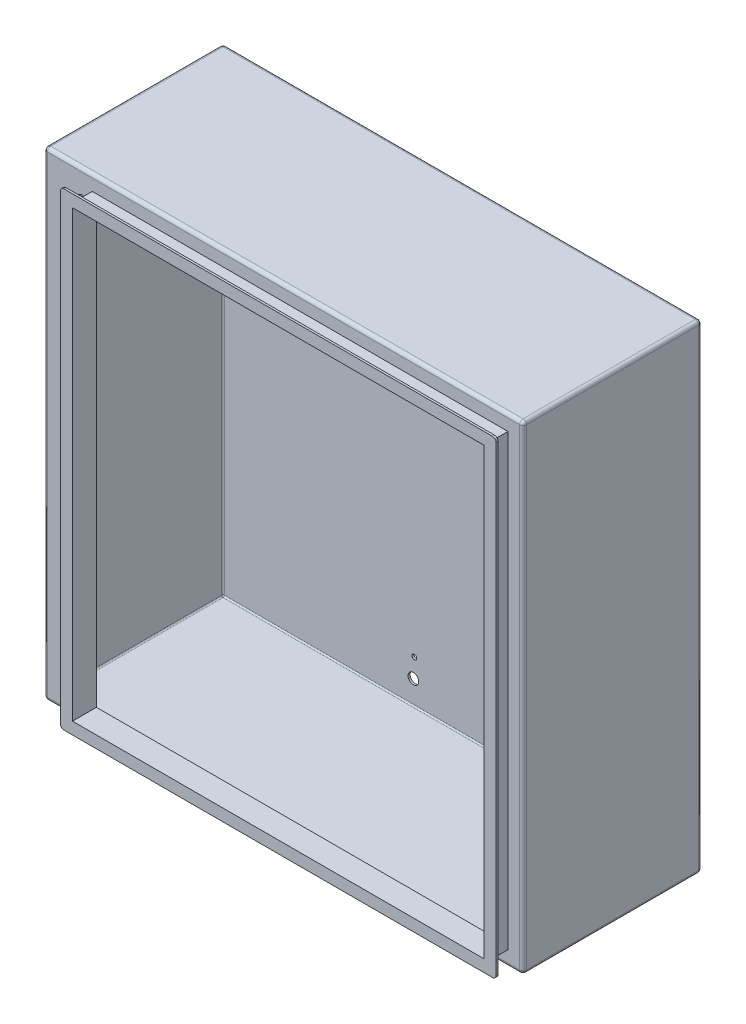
from build123d import *

# Parameters (mm, degrees)
SKETCH63_W                           = 355.6
SKETCH63_H                           = 355.6
BOSS_EXTRUDE1_DEPTH                  = 132.842
SKETCH64_W                           = 308.61
SKETCH64_H                           = 333.248
BOSS_EXTRUDE2_DEPTH                  = 14.732
FILLET1_R                            = 2.54
SHELL1_T                             = -1.524
SKETCH65_W                           = 323.342
SKETCH65_H                           = 347.98
SKETCH65_W_2                         = 305.562
SKETCH65_H_2                         = 330.2
BOSS_EXTRUDE3_DEPTH                  = 1.524
FILLET2_R                            = 2.54
CUT_EXTRUDE1_REACH                   = 294.328
SKETCH66_R                           = 1.7526
SKETCH66_R_2                         = 3.9624
F_17_64_0_26563_DIAMETER_HOLE1_D     = 6.747002
F_17_64_0_26563_DIAMETER_HOLE1_DEPTH = 1.524


with BuildPart() as part:
    # Sketch63 → Boss-Extrude1 (new body)
    with BuildSketch(Plane.XY):
        Rectangle(SKETCH63_W, SKETCH63_H)
    extrude(amount=BOSS_EXTRUDE1_DEPTH)

    # Sketch64 → Boss-Extrude2 (add)
    with BuildSketch(Plane.XY.offset(132.842)):
        with Locations((12.319, 0)):
            Rectangle(SKETCH64_W, SKETCH64_H)
    extrude(amount=BOSS_EXTRUDE2_DEPTH)

    # Fillet1
    fillet1_edges = [part.edges().sort_by_distance(p)[0] for p in [
        (177.8, 0, 132.842),
        (0, 177.8, 132.842),
        (-177.8, 0, 132.842),
        (0, 177.8, 0),
        (177.8, 0, 0),
        (0, -177.8, 0),
        (-177.8, 0, 0),
        (0, -177.8, 132.842),
        (-177.8, 177.8, 66.421),
        (177.8, 177.8, 66.421),
        (177.8, -177.8, 66.421),
        (-177.8, -177.8, 66.421),
    ]]
    fillet(fillet1_edges, radius=FILLET1_R)

    # Shell1
    shell1_openings = [part.faces().sort_by_distance(p)[0] for p in [
        (12.319, 0, 147.574),
    ]]
    offset(amount=SHELL1_T, openings=shell1_openings, kind=Kind.INTERSECTION)

    # Sketch65 → Boss-Extrude3 (add)
    with BuildSketch(Plane.XY.offset(147.574)):
        with Locations((12.319, 0)):
            Rectangle(SKETCH65_W, SKETCH65_H)
        with Locations((12.319, 0)):
            Rectangle(SKETCH65_W_2, SKETCH65_H_2, mode=Mode.SUBTRACT)
    extrude(amount=BOSS_EXTRUDE3_DEPTH)

    # Fillet2
    fillet2_edges = [part.edges().sort_by_distance(p)[0] for p in [
        (173.99, 173.99, 148.336),
        (-149.352, 173.99, 148.336),
        (-149.352, -173.99, 148.336),
        (173.99, -173.99, 148.336),
    ]]
    fillet(fillet2_edges, radius=FILLET2_R)

    # Sketch66 → Cut-Extrude1 (cut, up to next)
    with BuildSketch(Plane(origin=(0, 0, 0), x_dir=(-1, 0, 0), z_dir=(0, 0, -1)), mode=Mode.PRIVATE) as cut_extrude1_sk1:
        with Locations((34.16896135, -144.514863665)):
            Circle(SKETCH66_R)
    cut_extrude1_tool1 = extrude(cut_extrude1_sk1.sketch, amount=-CUT_EXTRUDE1_REACH, mode=Mode.PRIVATE) & part.part
    # Sketch66 → Cut-Extrude1 (cut, up to next)
    with BuildSketch(Plane(origin=(0, 0, 0), x_dir=(-1, 0, 0), z_dir=(0, 0, -1)), mode=Mode.PRIVATE) as cut_extrude1_sk2:
        with Locations((34.93096135, -158.758173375)):
            Circle(SKETCH66_R_2)
    cut_extrude1_tool2 = extrude(cut_extrude1_sk2.sketch, amount=-CUT_EXTRUDE1_REACH, mode=Mode.PRIVATE) & part.part
    # Sketch66 → Cut-Extrude1 (cut, up to next)
    with BuildSketch(Plane(origin=(0, 0, 0), x_dir=(-1, 0, 0), z_dir=(0, 0, -1)), mode=Mode.PRIVATE) as cut_extrude1_sk3:
        with Locations((-34.91903865, -158.758173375)):
            Circle(SKETCH66_R_2)
    cut_extrude1_tool3 = extrude(cut_extrude1_sk3.sketch, amount=-CUT_EXTRUDE1_REACH, mode=Mode.PRIVATE) & part.part
    # Sketch66 → Cut-Extrude1 (cut, up to next)
    with BuildSketch(Plane(origin=(0, 0, 0), x_dir=(-1, 0, 0), z_dir=(0, 0, -1)), mode=Mode.PRIVATE) as cut_extrude1_sk4:
        with Locations((-34.15703865, -144.514863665)):
            Circle(SKETCH66_R)
    cut_extrude1_tool4 = extrude(cut_extrude1_sk4.sketch, amount=-CUT_EXTRUDE1_REACH, mode=Mode.PRIVATE) & part.part
    # Sketch66 → Cut-Extrude1 (cut, up to next)
    with BuildSketch(Plane(origin=(0, 0, 0), x_dir=(-1, 0, 0), z_dir=(0, 0, -1)), mode=Mode.PRIVATE) as cut_extrude1_sk5:
        with Locations((34.16896135, 93.229585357)):
            Circle(SKETCH66_R)
    cut_extrude1_tool5 = extrude(cut_extrude1_sk5.sketch, amount=-CUT_EXTRUDE1_REACH, mode=Mode.PRIVATE) & part.part
    # Sketch66 → Cut-Extrude1 (cut, up to next)
    with BuildSketch(Plane(origin=(0, 0, 0), x_dir=(-1, 0, 0), z_dir=(0, 0, -1)), mode=Mode.PRIVATE) as cut_extrude1_sk6:
        with Locations((-34.15703865, 93.229585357)):
            Circle(SKETCH66_R)
    cut_extrude1_tool6 = extrude(cut_extrude1_sk6.sketch, amount=-CUT_EXTRUDE1_REACH, mode=Mode.PRIVATE) & part.part
    # Sketch66 → Cut-Extrude1 (cut, up to next)
    with BuildSketch(Plane(origin=(0, 0, 0), x_dir=(-1, 0, 0), z_dir=(0, 0, -1)), mode=Mode.PRIVATE) as cut_extrude1_sk7:
        with Locations((34.93096135, 158.754356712)):
            Circle(SKETCH66_R_2)
    cut_extrude1_tool7 = extrude(cut_extrude1_sk7.sketch, amount=-CUT_EXTRUDE1_REACH, mode=Mode.PRIVATE) & part.part
    # Sketch66 → Cut-Extrude1 (cut, up to next)
    with BuildSketch(Plane(origin=(0, 0, 0), x_dir=(-1, 0, 0), z_dir=(0, 0, -1)), mode=Mode.PRIVATE) as cut_extrude1_sk8:
        with Locations((-34.91903865, 158.741826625)):
            Circle(SKETCH66_R_2)
    cut_extrude1_tool8 = extrude(cut_extrude1_sk8.sketch, amount=-CUT_EXTRUDE1_REACH, mode=Mode.PRIVATE) & part.part
    # Sketch66 → Cut-Extrude1 (cut, up to next)
    with BuildSketch(Plane(origin=(0, 0, 0), x_dir=(-1, 0, 0), z_dir=(0, 0, -1)), mode=Mode.PRIVATE) as cut_extrude1_sk9:
        with BuildLine():
            ThreePointArc((-17.771931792, 138.784876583), (-25.39403865, 120.64358348), (-17.771931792, 102.502290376))
            ThreePointArc((-17.771931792, 102.502290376), (0.00596135, 84.44858348), (17.783854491, 102.502290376))
            ThreePointArc((17.783854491, 102.502290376), (25.40596135, 120.64358348), (17.783854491, 138.784876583))
            ThreePointArc((17.783854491, 138.784876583), (0.00596135, 156.83858348), (-17.771931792, 138.784876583))
        make_face()
    cut_extrude1_tool9 = extrude(cut_extrude1_sk9.sketch, amount=-CUT_EXTRUDE1_REACH, mode=Mode.PRIVATE) & part.part
    add(cut_extrude1_tool1.solids().sort_by_distance((-34.168961, -144.514864, 0))[0], mode=Mode.SUBTRACT)
    add(cut_extrude1_tool2.solids().sort_by_distance((-34.930961, -158.758173, 0))[0], mode=Mode.SUBTRACT)
    add(cut_extrude1_tool3.solids().sort_by_distance((34.919039, -158.758173, 0))[0], mode=Mode.SUBTRACT)
    add(cut_extrude1_tool4.solids().sort_by_distance((34.157039, -144.514864, 0))[0], mode=Mode.SUBTRACT)
    add(cut_extrude1_tool5.solids().sort_by_distance((-34.168961, 93.229585, 0))[0], mode=Mode.SUBTRACT)
    add(cut_extrude1_tool6.solids().sort_by_distance((34.157039, 93.229585, 0))[0], mode=Mode.SUBTRACT)
    add(cut_extrude1_tool7.solids().sort_by_distance((-34.930961, 158.754357, 0))[0], mode=Mode.SUBTRACT)
    add(cut_extrude1_tool8.solids().sort_by_distance((34.919039, 158.741827, 0))[0], mode=Mode.SUBTRACT)
    add(cut_extrude1_tool9.solids().sort_by_distance((-0.005961, 120.643583, 0))[0], mode=Mode.SUBTRACT)

    # 17_64 _0.26563_ Diameter Hole1
    with Locations(Plane.XY.offset(132.842)):
        with Locations((-149.61196135, 157.224091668), (-149.61196135, 115.314091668), (-149.61196135, -115.317908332), (-149.61196135, -157.227908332)):
            Hole(F_17_64_0_26563_DIAMETER_HOLE1_D / 2, depth=F_17_64_0_26563_DIAMETER_HOLE1_DEPTH)


solid = part.part
